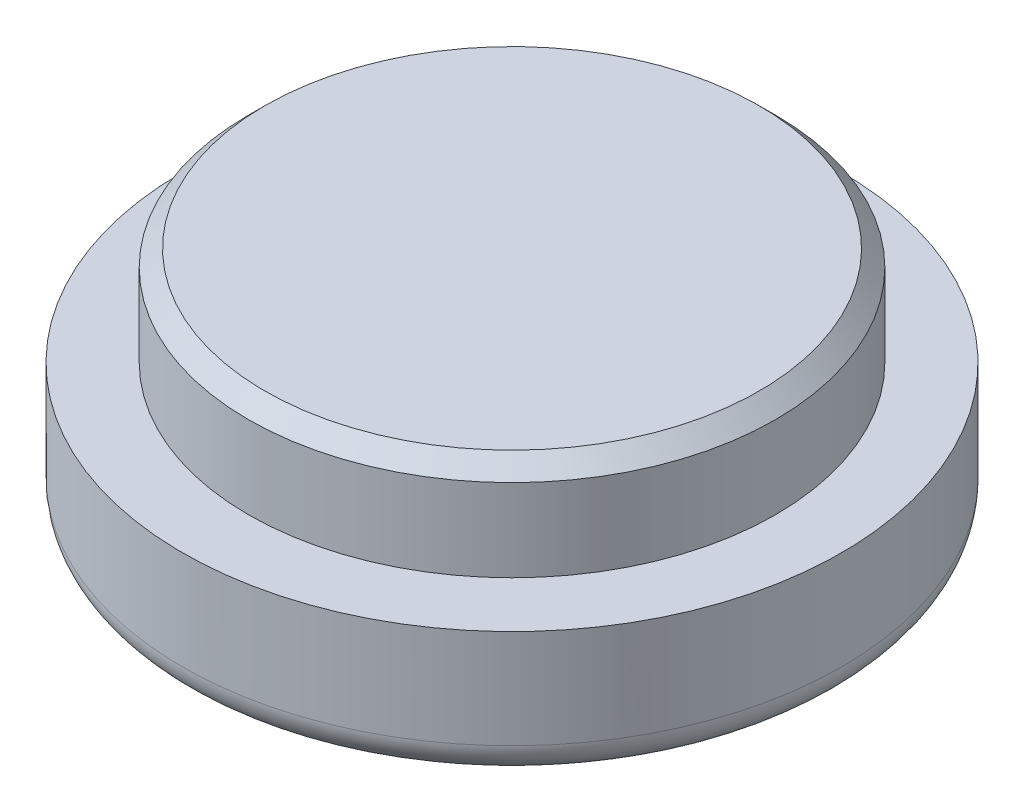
ISO-10303-21;
HEADER;
FILE_DESCRIPTION(('STEP AP214'),'2;1');
FILE_NAME('part.step','',(''),(''),'','','');
FILE_SCHEMA(('AUTOMOTIVE_DESIGN { 1 0 10303 214 1 1 1 1 }'));
ENDSEC;
DATA;
#1=APPLICATION_CONTEXT('core data for automotive mechanical design processes');
#2=APPLICATION_PROTOCOL_DEFINITION('international standard','automotive_design',2000,#1);
#3=PRODUCT_CONTEXT('',#1,'mechanical');
#4=PRODUCT('Part','Part','',(#3));
#5=PRODUCT_RELATED_PRODUCT_CATEGORY('part','',(#4));
#6=PRODUCT_DEFINITION_FORMATION('','',#4);
#7=PRODUCT_DEFINITION_CONTEXT('part definition',#1,'design');
#8=PRODUCT_DEFINITION('design','',#6,#7);
#9=PRODUCT_DEFINITION_SHAPE('','',#8);
#10=(LENGTH_UNIT() NAMED_UNIT(*) SI_UNIT(.MILLI.,.METRE.));
#11=(NAMED_UNIT(*) PLANE_ANGLE_UNIT() SI_UNIT($,.RADIAN.));
#12=(NAMED_UNIT(*) SI_UNIT($,.STERADIAN.) SOLID_ANGLE_UNIT());
#13=UNCERTAINTY_MEASURE_WITH_UNIT(LENGTH_MEASURE(1.E-05),#10,'distance_accuracy_value','');
#14=(GEOMETRIC_REPRESENTATION_CONTEXT(3) GLOBAL_UNCERTAINTY_ASSIGNED_CONTEXT((#13)) GLOBAL_UNIT_ASSIGNED_CONTEXT((#10,
#11,#12)) REPRESENTATION_CONTEXT('',''));
#15=CARTESIAN_POINT('',(0.,0.,0.));
#16=DIRECTION('',(0.,0.,1.));
#17=DIRECTION('',(1.,0.,0.));
#18=AXIS2_PLACEMENT_3D('',#15,#16,#17);
#19=CARTESIAN_POINT('',(0.,3.,0.));
#20=DIRECTION('',(0.,1.,0.));
#21=DIRECTION('',(-1.,0.,0.));
#22=AXIS2_PLACEMENT_3D('',#19,#20,#21);
#23=PLANE('',#22);
#24=CARTESIAN_POINT('',(0.,3.,0.));
#25=DIRECTION('',(0.,1.,0.));
#26=DIRECTION('',(-1.,0.,0.));
#27=AXIS2_PLACEMENT_3D('',#24,#25,#26);
#28=CIRCLE('',#27,7.50000000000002);
#29=CARTESIAN_POINT('',(-7.5,3.,0.));
#30=VERTEX_POINT('',#29);
#31=EDGE_CURVE('E38',#30,#30,#28,.T.);
#32=ORIENTED_EDGE('',*,*,#31,.T.);
#33=EDGE_LOOP('',(#32));
#34=FACE_BOUND('',#33,.T.);
#35=ADVANCED_FACE('F32',(#34),#23,.T.);
#36=CARTESIAN_POINT('',(0.,16.3778856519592,0.));
#37=DIRECTION('',(0.,1.,0.));
#38=DIRECTION('',(-1.,0.,0.));
#39=AXIS2_PLACEMENT_3D('',#36,#37,#38);
#40=CYLINDRICAL_SURFACE('',#39,8.00000000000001);
#41=CARTESIAN_POINT('',(0.,2.50000000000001,0.));
#42=DIRECTION('',(0.,1.,0.));
#43=DIRECTION('',(-1.,0.,0.));
#44=AXIS2_PLACEMENT_3D('',#41,#42,#43);
#45=CIRCLE('',#44,8.00000000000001);
#46=CARTESIAN_POINT('',(-8.,2.5,0.));
#47=VERTEX_POINT('',#46);
#48=EDGE_CURVE('E10',#47,#47,#45,.F.);
#49=ORIENTED_EDGE('',*,*,#48,.T.);
#50=EDGE_LOOP('',(#49));
#51=FACE_BOUND('',#50,.T.);
#52=CARTESIAN_POINT('',(0.,0.,0.));
#53=DIRECTION('',(0.,1.,0.));
#54=DIRECTION('',(-1.,0.,0.));
#55=AXIS2_PLACEMENT_3D('',#52,#53,#54);
#56=CIRCLE('',#55,8.00000000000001);
#57=CARTESIAN_POINT('',(-8.,0.,0.));
#58=VERTEX_POINT('',#57);
#59=EDGE_CURVE('E51',#58,#58,#56,.T.);
#60=ORIENTED_EDGE('',*,*,#59,.T.);
#61=EDGE_LOOP('',(#60));
#62=FACE_BOUND('',#61,.T.);
#63=ADVANCED_FACE('F73',(#51,#62),#40,.T.);
#64=CARTESIAN_POINT('',(-8.,0.,0.));
#65=DIRECTION('',(0.,1.,0.));
#66=DIRECTION('',(-1.,0.,0.));
#67=AXIS2_PLACEMENT_3D('',#64,#65,#66);
#68=PLANE('',#67);
#69=CARTESIAN_POINT('',(0.,0.,0.));
#70=DIRECTION('',(0.,1.,0.));
#71=DIRECTION('',(-1.,0.,0.));
#72=AXIS2_PLACEMENT_3D('',#69,#70,#71);
#73=CIRCLE('',#72,10.);
#74=CARTESIAN_POINT('',(-10.,0.,0.));
#75=VERTEX_POINT('',#74);
#76=EDGE_CURVE('E54',#75,#75,#73,.T.);
#77=ORIENTED_EDGE('',*,*,#76,.T.);
#78=EDGE_LOOP('',(#77));
#79=FACE_BOUND('',#78,.T.);
#80=ORIENTED_EDGE('',*,*,#59,.F.);
#81=EDGE_LOOP('',(#80));
#82=FACE_BOUND('',#81,.T.);
#83=ADVANCED_FACE('F58',(#79,#82),#68,.T.);
#84=CARTESIAN_POINT('',(0.,16.3778856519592,0.));
#85=DIRECTION('',(0.,1.,0.));
#86=DIRECTION('',(-1.,0.,0.));
#87=AXIS2_PLACEMENT_3D('',#84,#85,#86);
#88=CYLINDRICAL_SURFACE('',#87,10.);
#89=CARTESIAN_POINT('',(0.,-3.,0.));
#90=DIRECTION('',(0.,-1.,0.));
#91=DIRECTION('',(1.,0.,0.));
#92=AXIS2_PLACEMENT_3D('',#89,#90,#91);
#93=CIRCLE('',#92,10.);
#94=CARTESIAN_POINT('',(10.,-3.,0.));
#95=VERTEX_POINT('',#94);
#96=EDGE_CURVE('E46',#95,#95,#93,.F.);
#97=ORIENTED_EDGE('',*,*,#96,.T.);
#98=EDGE_LOOP('',(#97));
#99=FACE_BOUND('',#98,.T.);
#100=ORIENTED_EDGE('',*,*,#76,.F.);
#101=EDGE_LOOP('',(#100));
#102=FACE_BOUND('',#101,.T.);
#103=ADVANCED_FACE('F61',(#99,#102),#88,.T.);
#104=CARTESIAN_POINT('',(-10.,-4.,0.));
#105=DIRECTION('',(0.,-1.,0.));
#106=DIRECTION('',(1.,0.,0.));
#107=AXIS2_PLACEMENT_3D('',#104,#105,#106);
#108=PLANE('',#107);
#109=CARTESIAN_POINT('',(0.,-4.,0.));
#110=DIRECTION('',(0.,-1.,0.));
#111=DIRECTION('',(1.,0.,0.));
#112=AXIS2_PLACEMENT_3D('',#109,#110,#111);
#113=CIRCLE('',#112,9.00000000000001);
#114=CARTESIAN_POINT('',(9.00000000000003,-4.,0.));
#115=VERTEX_POINT('',#114);
#116=EDGE_CURVE('E42',#115,#115,#113,.T.);
#117=ORIENTED_EDGE('',*,*,#116,.T.);
#118=EDGE_LOOP('',(#117));
#119=FACE_BOUND('',#118,.T.);
#120=ADVANCED_FACE('F63',(#119),#108,.T.);
#121=CARTESIAN_POINT('',(0.,-3.,0.));
#122=DIRECTION('',(0.,-1.,0.));
#123=DIRECTION('',(1.,0.,0.));
#124=AXIS2_PLACEMENT_3D('',#121,#122,#123);
#125=TOROIDAL_SURFACE('',#124,9.00000000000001,1.);
#126=ORIENTED_EDGE('',*,*,#116,.F.);
#127=EDGE_LOOP('',(#126));
#128=FACE_BOUND('',#127,.T.);
#129=ORIENTED_EDGE('',*,*,#96,.F.);
#130=EDGE_LOOP('',(#129));
#131=FACE_BOUND('',#130,.T.);
#132=ADVANCED_FACE('F70',(#128,#131),#125,.T.);
#133=CARTESIAN_POINT('',(0.,3.,0.));
#134=DIRECTION('',(0.,-1.,0.));
#135=DIRECTION('',(1.,0.,0.));
#136=AXIS2_PLACEMENT_3D('',#133,#134,#135);
#137=CONICAL_SURFACE('',#136,7.50000000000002,0.785398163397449);
#138=ORIENTED_EDGE('',*,*,#48,.F.);
#139=EDGE_LOOP('',(#138));
#140=FACE_BOUND('',#139,.T.);
#141=ORIENTED_EDGE('',*,*,#31,.F.);
#142=EDGE_LOOP('',(#141));
#143=FACE_BOUND('',#142,.T.);
#144=ADVANCED_FACE('F106',(#140,#143),#137,.T.);
#145=CLOSED_SHELL('',(#35,#63,#83,#103,#120,#132,#144));
#146=MANIFOLD_SOLID_BREP('B2',#145);
#147=ADVANCED_BREP_SHAPE_REPRESENTATION('',(#18,#146),#14);
#148=SHAPE_DEFINITION_REPRESENTATION(#9,#147);
ENDSEC;
END-ISO-10303-21;
